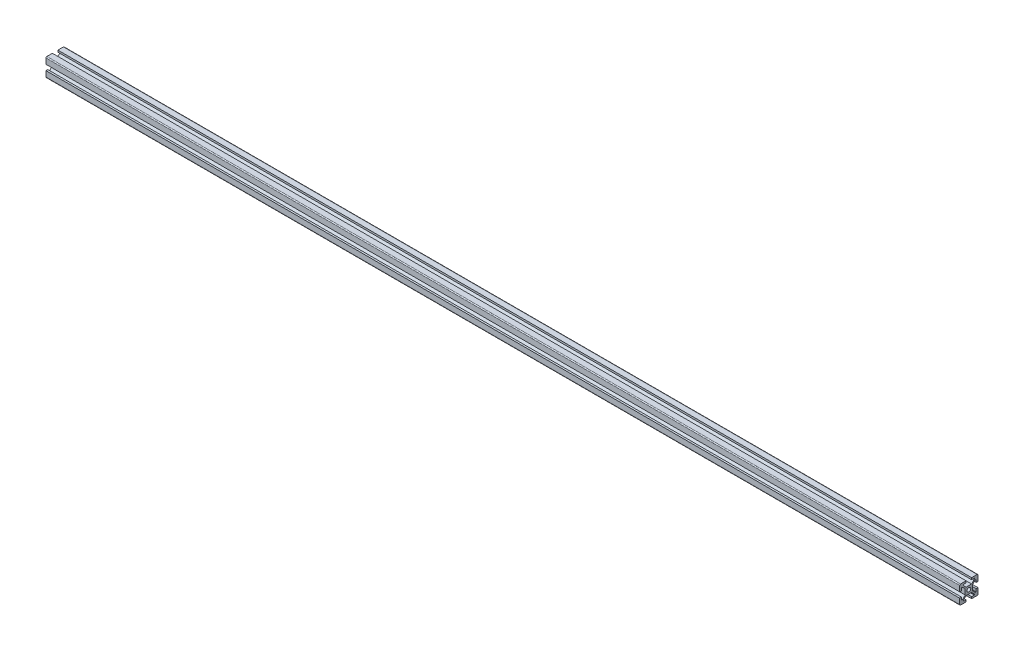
from build123d import *

# Parameters (mm, degrees)
SKETCH1_R           = 2.1
BOSS_EXTRUDE1_DEPTH = 1000


with BuildPart() as part:
    # Sketch1 → Boss-Extrude1 (new body)
    with BuildSketch(Plane(origin=(0, 0, 0), x_dir=(0, 0, -1), z_dir=(1, 0, 0))):
        with BuildLine():
            Line((-10, 9), (-10, 3))
            Line((-10, 3), (-8, 3))
            Line((-8, 3), (-8, 6))
            Line((-8, 6), (-7.060660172, 6))
            Line((-7.060660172, 6), (-4, 2.939339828))
            Line((-4, 2.939339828), (-4, -2.939339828))
            Line((-4, -2.939339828), (-7.060660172, -6))
            Line((-7.060660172, -6), (-8, -6))
            Line((-8, -6), (-8, -3))
            Line((-8, -3), (-10, -3))
            Line((-10, -3), (-10, -9))
            ThreePointArc((-10, -9), (-9.707106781, -9.707106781), (-9, -10))
            Line((-9, -10), (-3, -10))
            Line((-3, -10), (-3, -8))
            Line((-3, -8), (-6, -8))
            Line((-6, -8), (-6, -7.060660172))
            Line((-6, -7.060660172), (-2.939339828, -4))
            Line((-2.939339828, -4), (2.939339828, -4))
            Line((2.939339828, -4), (6, -7.060660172))
            Line((6, -7.060660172), (6, -8))
            Line((6, -8), (3, -8))
            Line((3, -8), (3, -10))
            Line((3, -10), (9, -10))
            ThreePointArc((9, -10), (9.707106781, -9.707106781), (10, -9))
            Line((10, -9), (10, -3))
            Line((10, -3), (8, -3))
            Line((8, -3), (8, -6))
            Line((8, -6), (7.060660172, -6))
            Line((7.060660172, -6), (4, -2.939339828))
            Line((4, -2.939339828), (4, 2.939339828))
            Line((4, 2.939339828), (7.060660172, 6))
            Line((7.060660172, 6), (8, 6))
            Line((8, 6), (8, 3))
            Line((8, 3), (10, 3))
            Line((10, 3), (10, 9))
            ThreePointArc((10, 9), (9.707106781, 9.707106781), (9, 10))
            Line((9, 10), (3, 10))
            Line((3, 10), (3, 8))
            Line((3, 8), (6, 8))
            Line((6, 8), (6, 7.060660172))
            Line((6, 7.060660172), (2.939339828, 4))
            Line((2.939339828, 4), (-2.939339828, 4))
            Line((-2.939339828, 4), (-6, 7.060660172))
            Line((-6, 7.060660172), (-6, 8))
            Line((-6, 8), (-3, 8))
            Line((-3, 8), (-3, 10))
            Line((-3, 10), (-9, 10))
            ThreePointArc((-9, 10), (-9.707106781, 9.707106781), (-10, 9))
        make_face()
        Circle(SKETCH1_R, mode=Mode.SUBTRACT)
    extrude(amount=BOSS_EXTRUDE1_DEPTH)


solid = part.part
